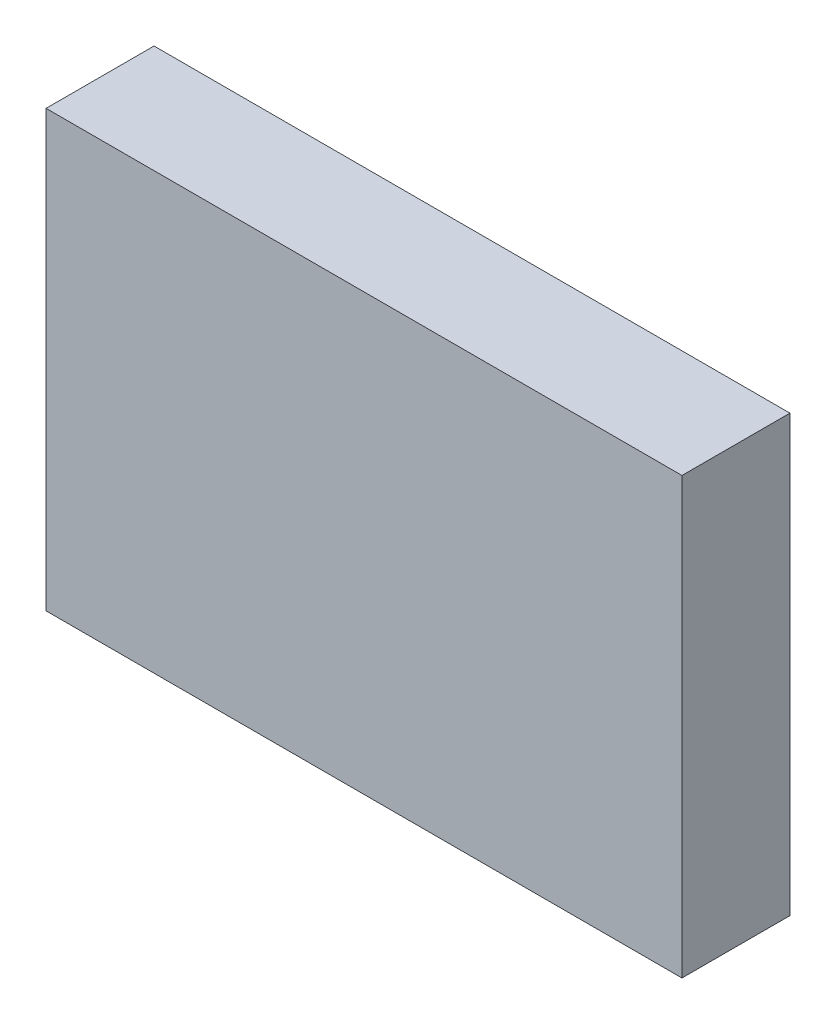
from build123d import *

# Parameters (mm, degrees)
SKETCH1_W      = 58.902178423
SKETCH1_H      = 40.313278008
EXTRUDE1_DEPTH = 10


with BuildPart() as part:
    # Sketch1 → Extrude1 (new body)
    with BuildSketch(Plane.XY):
        with Locations((-13.77370332, 8.286618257)):
            Rectangle(SKETCH1_W, SKETCH1_H)
    extrude(amount=EXTRUDE1_DEPTH)


solid = part.part
